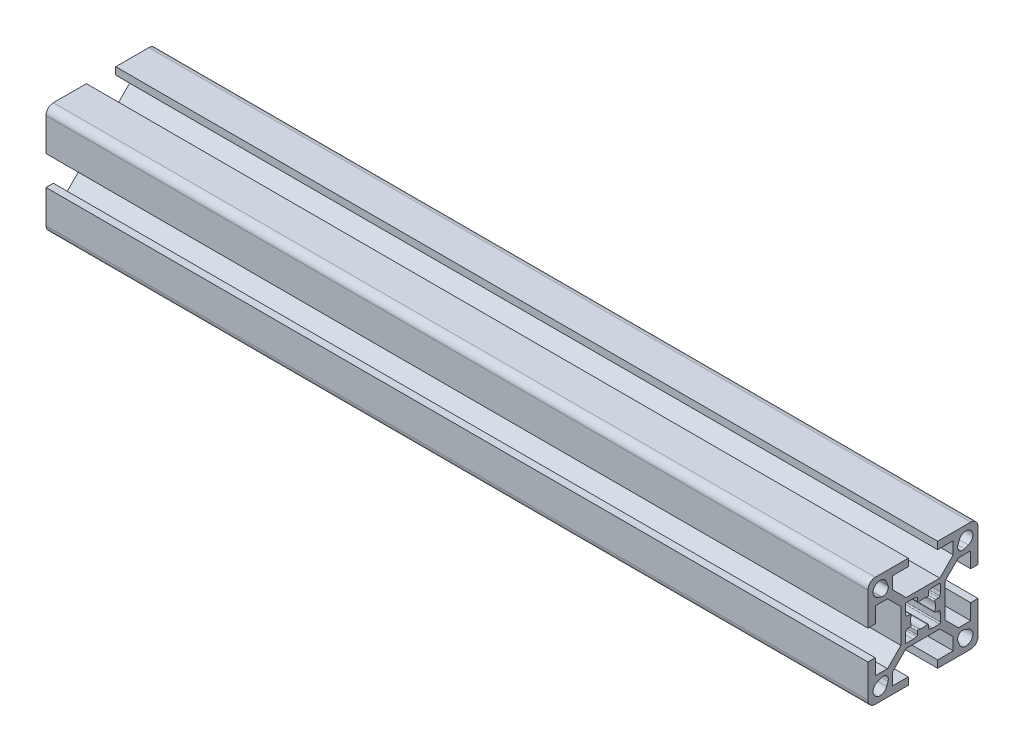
from build123d import *

# Parameters (mm, degrees)
BOSS_EXTRUDE1_DEPTH = 224


with BuildPart() as part:
    # Sketch1 → Boss-Extrude1 (new body)
    with BuildSketch(Plane(origin=(0, 0, 0), x_dir=(0, 0, -1), z_dir=(1, 0, 0))):
        with BuildLine():
            Line((-15, 13), (-15, 4))
            Line((-15, 4), (-13, 4))
            Line((-13, 4), (-13, 8.25))
            Line((-13, 8.25), (-9.664213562, 8.25))
            Line((-9.664213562, 8.25), (-6, 4.585786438))
            Line((-6, 4.585786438), (-6, -4.585786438))
            Line((-6, -4.585786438), (-9.664213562, -8.25))
            Line((-9.664213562, -8.25), (-13, -8.25))
            Line((-13, -8.25), (-13, -4))
            Line((-13, -4), (-15, -4))
            Line((-15, -4), (-15, -13))
            ThreePointArc((-15, -13), (-14.414213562, -14.414213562), (-13, -15))
            Line((-13, -15), (-4, -15))
            Line((-4, -15), (-4, -13))
            Line((-4, -13), (-8.25, -13))
            Line((-8.25, -13), (-8.25, -9.664213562))
            Line((-8.25, -9.664213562), (-4.585786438, -6))
            Line((-4.585786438, -6), (4.585786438, -6))
            Line((4.585786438, -6), (8.25, -9.664213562))
            Line((8.25, -9.664213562), (8.25, -13))
            Line((8.25, -13), (4, -13))
            Line((4, -13), (4, -15))
            Line((4, -15), (13, -15))
            ThreePointArc((13, -15), (14.414213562, -14.414213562), (15, -13))
            Line((15, -13), (15, -4))
            Line((15, -4), (13, -4))
            Line((13, -4), (13, -8.25))
            Line((13, -8.25), (9.664213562, -8.25))
            Line((9.664213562, -8.25), (6, -4.585786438))
            Line((6, -4.585786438), (6, 4.585786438))
            Line((6, 4.585786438), (9.664213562, 8.25))
            Line((9.664213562, 8.25), (13, 8.25))
            Line((13, 8.25), (13, 4))
            Line((13, 4), (15, 4))
            Line((15, 4), (15, 13))
            ThreePointArc((15, 13), (14.414213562, 14.414213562), (13, 15))
            Line((13, 15), (4, 15))
            Line((4, 15), (4, 13))
            Line((4, 13), (8.25, 13))
            Line((8.25, 13), (8.25, 9.664213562))
            Line((8.25, 9.664213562), (4.585786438, 6))
            Line((4.585786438, 6), (-4.585786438, 6))
            Line((-4.585786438, 6), (-8.25, 9.664213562))
            Line((-8.25, 9.664213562), (-8.25, 13))
            Line((-8.25, 13), (-4, 13))
            Line((-4, 13), (-4, 15))
            Line((-4, 15), (-13, 15))
            ThreePointArc((-13, 15), (-14.414213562, 14.414213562), (-15, 13))
        make_face()
        with BuildLine():
            Line((-9.539070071, 11.338915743), (-9.918883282, 12.361530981))
            ThreePointArc((-9.918883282, 12.361530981), (-13.043502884, 13.043502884), (-12.361530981, 9.918883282))
            Line((-12.361530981, 9.918883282), (-11.338915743, 9.539070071))
            ThreePointArc((-11.338915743, 9.539070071), (-9.861522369, 9.861522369), (-9.539070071, 11.338915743))
        make_face(mode=Mode.SUBTRACT)
        with BuildLine():
            Line((9.918883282, 12.361530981), (9.539070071, 11.338915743))
            ThreePointArc((9.539070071, 11.338915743), (9.861522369, 9.861522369), (11.338915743, 9.539070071))
            Line((11.338915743, 9.539070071), (12.361530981, 9.918883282))
            ThreePointArc((12.361530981, 9.918883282), (13.043502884, 13.043502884), (9.918883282, 12.361530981))
        make_face(mode=Mode.SUBTRACT)
        with BuildLine():
            Line((12.361530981, -9.918883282), (11.338915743, -9.539070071))
            ThreePointArc((11.338915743, -9.539070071), (9.861522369, -9.861522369), (9.539070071, -11.338915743))
            Line((9.539070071, -11.338915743), (9.918883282, -12.361530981))
            ThreePointArc((9.918883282, -12.361530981), (13.043502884, -13.043502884), (12.361530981, -9.918883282))
        make_face(mode=Mode.SUBTRACT)
        with BuildLine():
            Line((-11.338915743, -9.539070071), (-12.361530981, -9.918883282))
            ThreePointArc((-12.361530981, -9.918883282), (-13.043502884, -13.043502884), (-9.918883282, -12.361530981))
            Line((-9.918883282, -12.361530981), (-9.539070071, -11.338915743))
            ThreePointArc((-9.539070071, -11.338915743), (-9.861522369, -9.861522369), (-11.338915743, -9.539070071))
        make_face(mode=Mode.SUBTRACT)
        with BuildLine():
            Line((-4.8, -2.644433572), (-4.8, -4.5))
            ThreePointArc((-4.8, -4.5), (-4.712132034, -4.712132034), (-4.5, -4.8))
            Line((-4.5, -4.8), (-2.644433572, -4.8))
            ThreePointArc((-2.644433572, -4.8), (-2.615679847, -4.79861886), (-2.587190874, -4.794488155))
            Line((-2.587190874, -4.794488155), (-1.742757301, -4.630346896))
            ThreePointArc((-1.742757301, -4.630346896), (-1.568512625, -4.526682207), (-1.5, -4.335858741))
            Line((-1.5, -4.335858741), (-1.5, -3.5))
            ThreePointArc((-1.5, -3.5), (-1.374371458, -3.255879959), (-1.102702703, -3.216216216))
            ThreePointArc((-1.102702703, -3.216216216), (0, -3.4), (1.102702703, -3.216216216))
            ThreePointArc((1.102702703, -3.216216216), (1.374371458, -3.255879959), (1.5, -3.5))
            Line((1.5, -3.5), (1.5, -4.335858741))
            ThreePointArc((1.5, -4.335858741), (1.568512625, -4.526682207), (1.742757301, -4.630346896))
            Line((1.742757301, -4.630346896), (2.587190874, -4.794488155))
            ThreePointArc((2.587190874, -4.794488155), (2.615679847, -4.79861886), (2.644433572, -4.8))
            Line((2.644433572, -4.8), (4.5, -4.8))
            ThreePointArc((4.5, -4.8), (4.712132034, -4.712132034), (4.8, -4.5))
            Line((4.8, -4.5), (4.8, -2.644433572))
            ThreePointArc((4.8, -2.644433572), (4.79861886, -2.615679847), (4.794488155, -2.587190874))
            Line((4.794488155, -2.587190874), (4.630346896, -1.742757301))
            ThreePointArc((4.630346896, -1.742757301), (4.526682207, -1.568512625), (4.335858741, -1.5))
            Line((4.335858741, -1.5), (3.5, -1.5))
            ThreePointArc((3.5, -1.5), (3.255879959, -1.374371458), (3.216216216, -1.102702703))
            ThreePointArc((3.216216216, -1.102702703), (3.4, 0), (3.216216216, 1.102702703))
            ThreePointArc((3.216216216, 1.102702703), (3.255879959, 1.374371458), (3.5, 1.5))
            Line((3.5, 1.5), (4.335858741, 1.5))
            ThreePointArc((4.335858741, 1.5), (4.526682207, 1.568512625), (4.630346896, 1.742757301))
            Line((4.630346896, 1.742757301), (4.794488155, 2.587190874))
            ThreePointArc((4.794488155, 2.587190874), (4.79861886, 2.615679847), (4.8, 2.644433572))
            Line((4.8, 2.644433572), (4.8, 4.5))
            ThreePointArc((4.8, 4.5), (4.712132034, 4.712132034), (4.5, 4.8))
            Line((4.5, 4.8), (2.644433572, 4.8))
            ThreePointArc((2.644433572, 4.8), (2.615679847, 4.79861886), (2.587190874, 4.794488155))
            Line((2.587190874, 4.794488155), (1.742757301, 4.630346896))
            ThreePointArc((1.742757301, 4.630346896), (1.568512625, 4.526682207), (1.5, 4.335858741))
            Line((1.5, 4.335858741), (1.5, 3.5))
            ThreePointArc((1.5, 3.5), (1.374371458, 3.255879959), (1.102702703, 3.216216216))
            ThreePointArc((1.102702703, 3.216216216), (0, 3.4), (-1.102702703, 3.216216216))
            ThreePointArc((-1.102702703, 3.216216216), (-1.374371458, 3.255879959), (-1.5, 3.5))
            Line((-1.5, 3.5), (-1.5, 4.335858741))
            ThreePointArc((-1.5, 4.335858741), (-1.568512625, 4.526682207), (-1.742757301, 4.630346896))
            Line((-1.742757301, 4.630346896), (-2.587190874, 4.794488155))
            ThreePointArc((-2.587190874, 4.794488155), (-2.615679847, 4.79861886), (-2.644433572, 4.8))
            Line((-2.644433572, 4.8), (-4.5, 4.8))
            ThreePointArc((-4.5, 4.8), (-4.712132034, 4.712132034), (-4.8, 4.5))
            Line((-4.8, 4.5), (-4.8, 2.644433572))
            ThreePointArc((-4.8, 2.644433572), (-4.79861886, 2.615679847), (-4.794488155, 2.587190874))
            Line((-4.794488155, 2.587190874), (-4.630346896, 1.742757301))
            ThreePointArc((-4.630346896, 1.742757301), (-4.526682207, 1.568512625), (-4.335858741, 1.5))
            Line((-4.335858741, 1.5), (-3.5, 1.5))
            ThreePointArc((-3.5, 1.5), (-3.255879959, 1.374371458), (-3.216216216, 1.102702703))
            ThreePointArc((-3.216216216, 1.102702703), (-3.4, 0), (-3.216216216, -1.102702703))
            ThreePointArc((-3.216216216, -1.102702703), (-3.255879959, -1.374371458), (-3.5, -1.5))
            Line((-3.5, -1.5), (-4.335858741, -1.5))
            ThreePointArc((-4.335858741, -1.5), (-4.526682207, -1.568512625), (-4.630346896, -1.742757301))
            Line((-4.630346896, -1.742757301), (-4.794488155, -2.587190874))
            ThreePointArc((-4.794488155, -2.587190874), (-4.79861886, -2.615679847), (-4.8, -2.644433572))
        make_face(mode=Mode.SUBTRACT)
    extrude(amount=BOSS_EXTRUDE1_DEPTH)


solid = part.part
